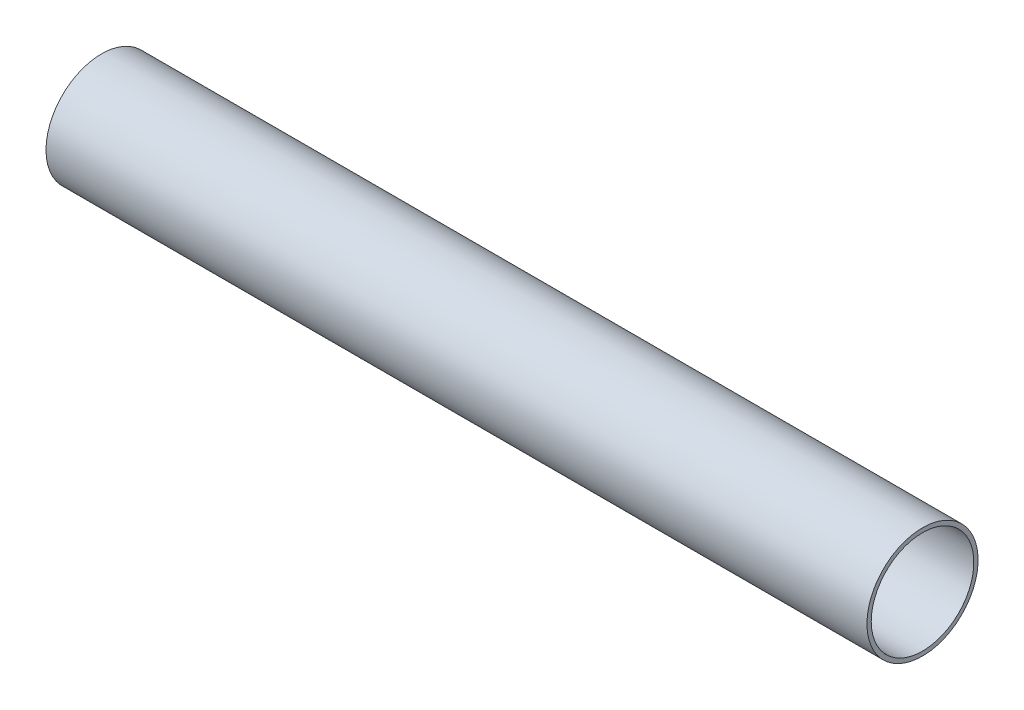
ISO-10303-21;
HEADER;
FILE_DESCRIPTION(('STEP AP214'),'2;1');
FILE_NAME('part.step','',(''),(''),'','','');
FILE_SCHEMA(('AUTOMOTIVE_DESIGN { 1 0 10303 214 1 1 1 1 }'));
ENDSEC;
DATA;
#1=APPLICATION_CONTEXT('core data for automotive mechanical design processes');
#2=APPLICATION_PROTOCOL_DEFINITION('international standard','automotive_design',2000,#1);
#3=PRODUCT_CONTEXT('',#1,'mechanical');
#4=PRODUCT('Part','Part','',(#3));
#5=PRODUCT_RELATED_PRODUCT_CATEGORY('part','',(#4));
#6=PRODUCT_DEFINITION_FORMATION('','',#4);
#7=PRODUCT_DEFINITION_CONTEXT('part definition',#1,'design');
#8=PRODUCT_DEFINITION('design','',#6,#7);
#9=PRODUCT_DEFINITION_SHAPE('','',#8);
#10=(LENGTH_UNIT() NAMED_UNIT(*) SI_UNIT(.MILLI.,.METRE.));
#11=(NAMED_UNIT(*) PLANE_ANGLE_UNIT() SI_UNIT($,.RADIAN.));
#12=(NAMED_UNIT(*) SI_UNIT($,.STERADIAN.) SOLID_ANGLE_UNIT());
#13=UNCERTAINTY_MEASURE_WITH_UNIT(LENGTH_MEASURE(1.E-05),#10,'distance_accuracy_value','');
#14=(GEOMETRIC_REPRESENTATION_CONTEXT(3) GLOBAL_UNCERTAINTY_ASSIGNED_CONTEXT((#13)) GLOBAL_UNIT_ASSIGNED_CONTEXT((#10,
#11,#12)) REPRESENTATION_CONTEXT('',''));
#15=CARTESIAN_POINT('',(0.,0.,0.));
#16=DIRECTION('',(0.,0.,1.));
#17=DIRECTION('',(1.,0.,0.));
#18=AXIS2_PLACEMENT_3D('',#15,#16,#17);
#19=CARTESIAN_POINT('',(304.8,0.,0.));
#20=DIRECTION('',(1.,0.,0.));
#21=DIRECTION('',(0.,0.,-1.));
#22=AXIS2_PLACEMENT_3D('',#19,#20,#21);
#23=PLANE('',#22);
#24=CARTESIAN_POINT('',(304.8,0.,0.));
#25=DIRECTION('',(1.,0.,0.));
#26=DIRECTION('',(0.,0.,-1.));
#27=AXIS2_PLACEMENT_3D('',#24,#25,#26);
#28=CIRCLE('',#27,20.6375);
#29=CARTESIAN_POINT('',(304.8,0.,20.6375));
#30=VERTEX_POINT('',#29);
#31=EDGE_CURVE('E10',#30,#30,#28,.T.);
#32=ORIENTED_EDGE('',*,*,#31,.T.);
#33=EDGE_LOOP('',(#32));
#34=FACE_BOUND('',#33,.T.);
#35=CARTESIAN_POINT('',(304.8,0.,0.));
#36=DIRECTION('',(1.,0.,0.));
#37=DIRECTION('',(0.,0.,-1.));
#38=AXIS2_PLACEMENT_3D('',#35,#36,#37);
#39=CIRCLE('',#38,19.05);
#40=CARTESIAN_POINT('',(304.8,0.,19.05));
#41=VERTEX_POINT('',#40);
#42=EDGE_CURVE('E39',#41,#41,#39,.T.);
#43=ORIENTED_EDGE('',*,*,#42,.F.);
#44=EDGE_LOOP('',(#43));
#45=FACE_BOUND('',#44,.T.);
#46=ADVANCED_FACE('F28',(#34,#45),#23,.T.);
#47=CARTESIAN_POINT('',(0.,0.,0.));
#48=DIRECTION('',(1.,0.,0.));
#49=DIRECTION('',(0.,0.,-1.));
#50=AXIS2_PLACEMENT_3D('',#47,#48,#49);
#51=PLANE('',#50);
#52=CARTESIAN_POINT('',(0.,0.,0.));
#53=DIRECTION('',(1.,0.,0.));
#54=DIRECTION('',(0.,0.,-1.));
#55=AXIS2_PLACEMENT_3D('',#52,#53,#54);
#56=CIRCLE('',#55,20.6375);
#57=CARTESIAN_POINT('',(0.,0.,20.6375));
#58=VERTEX_POINT('',#57);
#59=EDGE_CURVE('E35',#58,#58,#56,.T.);
#60=ORIENTED_EDGE('',*,*,#59,.F.);
#61=EDGE_LOOP('',(#60));
#62=FACE_BOUND('',#61,.T.);
#63=CARTESIAN_POINT('',(0.,0.,0.));
#64=DIRECTION('',(1.,0.,0.));
#65=DIRECTION('',(0.,0.,-1.));
#66=AXIS2_PLACEMENT_3D('',#63,#64,#65);
#67=CIRCLE('',#66,19.05);
#68=CARTESIAN_POINT('',(0.,0.,19.05));
#69=VERTEX_POINT('',#68);
#70=EDGE_CURVE('E43',#69,#69,#67,.T.);
#71=ORIENTED_EDGE('',*,*,#70,.T.);
#72=EDGE_LOOP('',(#71));
#73=FACE_BOUND('',#72,.T.);
#74=ADVANCED_FACE('F49',(#62,#73),#51,.F.);
#75=CARTESIAN_POINT('',(304.8,0.,0.));
#76=DIRECTION('',(-1.,0.,0.));
#77=DIRECTION('',(0.,0.,1.));
#78=AXIS2_PLACEMENT_3D('',#75,#76,#77);
#79=CYLINDRICAL_SURFACE('',#78,20.6375);
#80=CARTESIAN_POINT('',(304.8,0.,20.6375));
#81=CARTESIAN_POINT('',(301.625,0.,20.6375));
#82=CARTESIAN_POINT('',(298.45,0.,20.6375));
#83=CARTESIAN_POINT('',(292.1,0.,20.6375));
#84=CARTESIAN_POINT('',(288.925,0.,20.6375));
#85=CARTESIAN_POINT('',(282.575,0.,20.6375));
#86=CARTESIAN_POINT('',(279.4,0.,20.6375));
#87=CARTESIAN_POINT('',(273.05,0.,20.6375));
#88=CARTESIAN_POINT('',(269.875,0.,20.6375));
#89=CARTESIAN_POINT('',(263.525,0.,20.6375));
#90=CARTESIAN_POINT('',(260.35,0.,20.6375));
#91=CARTESIAN_POINT('',(254.,0.,20.6375));
#92=CARTESIAN_POINT('',(250.825,0.,20.6375));
#93=CARTESIAN_POINT('',(244.475,0.,20.6375));
#94=CARTESIAN_POINT('',(241.3,0.,20.6375));
#95=CARTESIAN_POINT('',(234.95,0.,20.6375));
#96=CARTESIAN_POINT('',(231.775,0.,20.6375));
#97=CARTESIAN_POINT('',(225.425,0.,20.6375));
#98=CARTESIAN_POINT('',(222.25,0.,20.6375));
#99=CARTESIAN_POINT('',(215.9,0.,20.6375));
#100=CARTESIAN_POINT('',(212.725,0.,20.6375));
#101=CARTESIAN_POINT('',(206.375,0.,20.6375));
#102=CARTESIAN_POINT('',(203.2,0.,20.6375));
#103=CARTESIAN_POINT('',(196.85,0.,20.6375));
#104=CARTESIAN_POINT('',(193.675,0.,20.6375));
#105=CARTESIAN_POINT('',(187.325,0.,20.6375));
#106=CARTESIAN_POINT('',(184.15,0.,20.6375));
#107=CARTESIAN_POINT('',(177.8,0.,20.6375));
#108=CARTESIAN_POINT('',(174.625,0.,20.6375));
#109=CARTESIAN_POINT('',(168.275,0.,20.6375));
#110=CARTESIAN_POINT('',(165.1,0.,20.6375));
#111=CARTESIAN_POINT('',(158.75,0.,20.6375));
#112=CARTESIAN_POINT('',(155.575,0.,20.6375));
#113=CARTESIAN_POINT('',(149.225,0.,20.6375));
#114=CARTESIAN_POINT('',(146.05,0.,20.6375));
#115=CARTESIAN_POINT('',(139.7,0.,20.6375));
#116=CARTESIAN_POINT('',(136.525,0.,20.6375));
#117=CARTESIAN_POINT('',(130.175,0.,20.6375));
#118=CARTESIAN_POINT('',(127.,0.,20.6375));
#119=CARTESIAN_POINT('',(120.65,0.,20.6375));
#120=CARTESIAN_POINT('',(117.475,0.,20.6375));
#121=CARTESIAN_POINT('',(111.125,0.,20.6375));
#122=CARTESIAN_POINT('',(107.95,0.,20.6375));
#123=CARTESIAN_POINT('',(101.6,0.,20.6375));
#124=CARTESIAN_POINT('',(98.425,0.,20.6375));
#125=CARTESIAN_POINT('',(92.075,0.,20.6375));
#126=CARTESIAN_POINT('',(88.9,0.,20.6375));
#127=CARTESIAN_POINT('',(82.55,0.,20.6375));
#128=CARTESIAN_POINT('',(79.375,0.,20.6375));
#129=CARTESIAN_POINT('',(73.025,0.,20.6375));
#130=CARTESIAN_POINT('',(69.85,0.,20.6375));
#131=CARTESIAN_POINT('',(63.5,0.,20.6375));
#132=CARTESIAN_POINT('',(60.325,0.,20.6375));
#133=CARTESIAN_POINT('',(53.975,0.,20.6375));
#134=CARTESIAN_POINT('',(50.8,0.,20.6375));
#135=CARTESIAN_POINT('',(44.45,0.,20.6375));
#136=CARTESIAN_POINT('',(41.275,0.,20.6375));
#137=CARTESIAN_POINT('',(34.925,0.,20.6375));
#138=CARTESIAN_POINT('',(31.75,0.,20.6375));
#139=CARTESIAN_POINT('',(25.4,0.,20.6375));
#140=CARTESIAN_POINT('',(22.225,0.,20.6375));
#141=CARTESIAN_POINT('',(15.875,0.,20.6375));
#142=CARTESIAN_POINT('',(12.7,0.,20.6375));
#143=CARTESIAN_POINT('',(6.35,0.,20.6375));
#144=CARTESIAN_POINT('',(3.175,0.,20.6375));
#145=CARTESIAN_POINT('',(0.,0.,20.6375));
#146=B_SPLINE_CURVE_WITH_KNOTS('',3,(#80,#81,#82,#83,#84,#85,#86,#87,#88,#89,#90,#91,#92,#93,
#94,#95,#96,#97,#98,#99,#100,#101,#102,#103,#104,#105,#106,#107,#108,#109,#110,#111,#112,#113,
#114,#115,#116,#117,#118,#119,#120,#121,#122,#123,#124,#125,#126,#127,#128,#129,#130,#131,#132,
#133,#134,#135,#136,#137,#138,#139,#140,#141,#142,#143,#144,#145),.UNSPECIFIED.,.F.,.F.,(4,2,2,
2,2,2,2,2,2,2,2,2,2,2,2,2,2,2,2,2,2,2,2,2,2,2,2,2,2,2,2,2,4),(0.,9.52499999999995,19.05,28.575,
38.1,47.625,57.15,66.675,76.2,85.725,95.2499999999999,104.775,114.3,123.825,133.35,142.875,
152.4,161.925,171.45,180.975,190.5,200.025,209.55,219.075,228.6,238.125,247.65,257.175,266.7,
276.225,285.75,295.275,304.8),.UNSPECIFIED.);
#147=EDGE_CURVE('BSEAM30',#30,#58,#146,.T.);
#148=ORIENTED_EDGE('',*,*,#31,.F.);
#149=ORIENTED_EDGE('',*,*,#59,.T.);
#150=ORIENTED_EDGE('',*,*,#147,.T.);
#151=ORIENTED_EDGE('',*,*,#147,.F.);
#152=EDGE_LOOP('',(#148,#150,#149,#151));
#153=FACE_BOUND('',#152,.T.);
#154=ADVANCED_FACE('F30',(#153),#79,.T.);
#155=CARTESIAN_POINT('',(304.8,0.,0.));
#156=DIRECTION('',(-1.,0.,0.));
#157=DIRECTION('',(0.,0.,1.));
#158=AXIS2_PLACEMENT_3D('',#155,#156,#157);
#159=CYLINDRICAL_SURFACE('',#158,19.05);
#160=CARTESIAN_POINT('',(304.8,0.,19.05));
#161=CARTESIAN_POINT('',(301.625,0.,19.05));
#162=CARTESIAN_POINT('',(298.45,0.,19.05));
#163=CARTESIAN_POINT('',(292.1,0.,19.05));
#164=CARTESIAN_POINT('',(288.925,0.,19.05));
#165=CARTESIAN_POINT('',(282.575,0.,19.05));
#166=CARTESIAN_POINT('',(279.4,0.,19.05));
#167=CARTESIAN_POINT('',(273.05,0.,19.05));
#168=CARTESIAN_POINT('',(269.875,0.,19.05));
#169=CARTESIAN_POINT('',(263.525,0.,19.05));
#170=CARTESIAN_POINT('',(260.35,0.,19.05));
#171=CARTESIAN_POINT('',(254.,0.,19.05));
#172=CARTESIAN_POINT('',(250.825,0.,19.05));
#173=CARTESIAN_POINT('',(244.475,0.,19.05));
#174=CARTESIAN_POINT('',(241.3,0.,19.05));
#175=CARTESIAN_POINT('',(234.95,0.,19.05));
#176=CARTESIAN_POINT('',(231.775,0.,19.05));
#177=CARTESIAN_POINT('',(225.425,0.,19.05));
#178=CARTESIAN_POINT('',(222.25,0.,19.05));
#179=CARTESIAN_POINT('',(215.9,0.,19.05));
#180=CARTESIAN_POINT('',(212.725,0.,19.05));
#181=CARTESIAN_POINT('',(206.375,0.,19.05));
#182=CARTESIAN_POINT('',(203.2,0.,19.05));
#183=CARTESIAN_POINT('',(196.85,0.,19.05));
#184=CARTESIAN_POINT('',(193.675,0.,19.05));
#185=CARTESIAN_POINT('',(187.325,0.,19.05));
#186=CARTESIAN_POINT('',(184.15,0.,19.05));
#187=CARTESIAN_POINT('',(177.8,0.,19.05));
#188=CARTESIAN_POINT('',(174.625,0.,19.05));
#189=CARTESIAN_POINT('',(168.275,0.,19.05));
#190=CARTESIAN_POINT('',(165.1,0.,19.05));
#191=CARTESIAN_POINT('',(158.75,0.,19.05));
#192=CARTESIAN_POINT('',(155.575,0.,19.05));
#193=CARTESIAN_POINT('',(149.225,0.,19.05));
#194=CARTESIAN_POINT('',(146.05,0.,19.05));
#195=CARTESIAN_POINT('',(139.7,0.,19.05));
#196=CARTESIAN_POINT('',(136.525,0.,19.05));
#197=CARTESIAN_POINT('',(130.175,0.,19.05));
#198=CARTESIAN_POINT('',(127.,0.,19.05));
#199=CARTESIAN_POINT('',(120.65,0.,19.05));
#200=CARTESIAN_POINT('',(117.475,0.,19.05));
#201=CARTESIAN_POINT('',(111.125,0.,19.05));
#202=CARTESIAN_POINT('',(107.95,0.,19.05));
#203=CARTESIAN_POINT('',(101.6,0.,19.05));
#204=CARTESIAN_POINT('',(98.425,0.,19.05));
#205=CARTESIAN_POINT('',(92.075,0.,19.05));
#206=CARTESIAN_POINT('',(88.9,0.,19.05));
#207=CARTESIAN_POINT('',(82.55,0.,19.05));
#208=CARTESIAN_POINT('',(79.375,0.,19.05));
#209=CARTESIAN_POINT('',(73.025,0.,19.05));
#210=CARTESIAN_POINT('',(69.85,0.,19.05));
#211=CARTESIAN_POINT('',(63.5,0.,19.05));
#212=CARTESIAN_POINT('',(60.325,0.,19.05));
#213=CARTESIAN_POINT('',(53.975,0.,19.05));
#214=CARTESIAN_POINT('',(50.8,0.,19.05));
#215=CARTESIAN_POINT('',(44.45,0.,19.05));
#216=CARTESIAN_POINT('',(41.275,0.,19.05));
#217=CARTESIAN_POINT('',(34.925,0.,19.05));
#218=CARTESIAN_POINT('',(31.75,0.,19.05));
#219=CARTESIAN_POINT('',(25.4,0.,19.05));
#220=CARTESIAN_POINT('',(22.225,0.,19.05));
#221=CARTESIAN_POINT('',(15.875,0.,19.05));
#222=CARTESIAN_POINT('',(12.7,0.,19.05));
#223=CARTESIAN_POINT('',(6.35,0.,19.05));
#224=CARTESIAN_POINT('',(3.175,0.,19.05));
#225=CARTESIAN_POINT('',(0.,0.,19.05));
#226=B_SPLINE_CURVE_WITH_KNOTS('',3,(#160,#161,#162,#163,#164,#165,#166,#167,#168,#169,#170,
#171,#172,#173,#174,#175,#176,#177,#178,#179,#180,#181,#182,#183,#184,#185,#186,#187,#188,#189,
#190,#191,#192,#193,#194,#195,#196,#197,#198,#199,#200,#201,#202,#203,#204,#205,#206,#207,#208,
#209,#210,#211,#212,#213,#214,#215,#216,#217,#218,#219,#220,#221,#222,#223,#224,#225),
.UNSPECIFIED.,.F.,.F.,(4,2,2,2,2,2,2,2,2,2,2,2,2,2,2,2,2,2,2,2,2,2,2,2,2,2,2,2,2,2,2,2,4),(0.,
9.52500000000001,19.05,28.575,38.1,47.625,57.15,66.675,76.2,85.7250000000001,95.2500000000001,
104.775,114.3,123.825,133.35,142.875,152.4,161.925,171.45,180.975,190.5,200.025,209.55,219.075,
228.6,238.125,247.65,257.175,266.7,276.225,285.75,295.275,304.8),.UNSPECIFIED.);
#227=EDGE_CURVE('BSEAM51',#41,#69,#226,.T.);
#228=ORIENTED_EDGE('',*,*,#42,.T.);
#229=ORIENTED_EDGE('',*,*,#70,.F.);
#230=ORIENTED_EDGE('',*,*,#227,.T.);
#231=ORIENTED_EDGE('',*,*,#227,.F.);
#232=EDGE_LOOP('',(#228,#230,#229,#231));
#233=FACE_BOUND('',#232,.T.);
#234=ADVANCED_FACE('F51',(#233),#159,.F.);
#235=CLOSED_SHELL('',(#46,#74,#154,#234));
#236=MANIFOLD_SOLID_BREP('B2',#235);
#237=ADVANCED_BREP_SHAPE_REPRESENTATION('',(#18,#236),#14);
#238=SHAPE_DEFINITION_REPRESENTATION(#9,#237);
ENDSEC;
END-ISO-10303-21;
